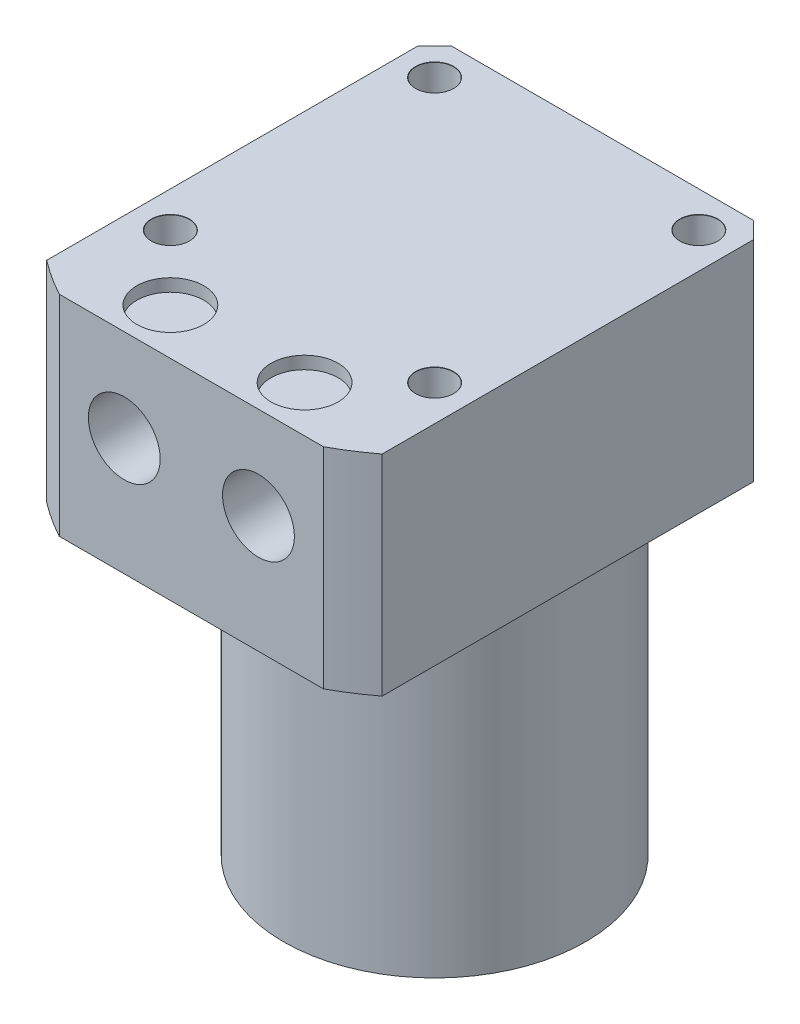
from build123d import *

# Parameters (mm, degrees)
SKETCH2_OUTSIDE_W                            = 90.692
SKETCH2_OUTSIDE_H                            = 90.692
SKETCH2_OUTSIDE_W_2                          = 40
SKETCH2_OUTSIDE_H_2                          = 49
CUT_EXTRUDE2_DEPTH                           = 80.613127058
CHAMFER1_SIZE                                = 2
F_8_0_8_DIAMETER_HOLE1_D                     = 8
F_8_0_8_DIAMETER_HOLE1_DEPTH                 = 1.5
G1_8_TAPPED_HOLE1_D                          = 8.566
G1_8_TAPPED_HOLE1_DEPTH                      = 22.18
CBORE_FOR_M4_HEX_SOCKET_HEAD_CAP_SCR_2_COUNT = 2
CBORE_FOR_M4_HEX_SOCKET_HEAD_CAP_SCR_2_PITCH = 31.5
CBORE_FOR_M4_HEX_SOCKET_HEAD_CAP_SCR_3_COUNT = 2
CBORE_FOR_M4_HEX_SOCKET_HEAD_CAP_SCR_3_PITCH = 44.547727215
CBORE_FOR_M4_HEX_SOCKET_HEAD_CAP_SCR_4_COUNT = 2
CBORE_FOR_M4_HEX_SOCKET_HEAD_CAP_SCR_4_PITCH = 31.5


with BuildPart() as part:
    # Sketch1 → Revolve1 (revolve)
    with BuildSketch(Plane.XY, mode=Mode.PRIVATE) as revolve1_sk:
        Polygon((0, 0), (-18, 0), (-18, 39.5), (-33, 39.5), (-33, 64.5), (0, 64.5), align=None)
    revolve(revolve1_sk.sketch.rotate(Axis((0, 87.050829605, 0), (0, -1, 0)), 270), axis=Axis((0, 87.050829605, 0), (0, -1, 0)))

    # Sketch2 outside → Cut-Extrude2 (cut, through all)
    with BuildSketch(Plane(origin=(0, 64.5, 0), x_dir=(1, 0, 0), z_dir=(0, 1, 0))):
        Rectangle(SKETCH2_OUTSIDE_W, SKETCH2_OUTSIDE_H)
        with Locations((0, -4.5)):
            Rectangle(SKETCH2_OUTSIDE_W_2, SKETCH2_OUTSIDE_H_2, mode=Mode.SUBTRACT)
    extrude(amount=-CUT_EXTRUDE2_DEPTH, mode=Mode.SUBTRACT)

    # Chamfer1
    chamfer1_edges = [part.edges().sort_by_distance(p)[0] for p in [
        (-20, 52, -20),
        (20, 52, -20),
    ]]
    chamfer(chamfer1_edges, length=CHAMFER1_SIZE)

    # 8.0 _8_ Diameter Hole1
    with Locations(Plane(origin=(-22.940510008, 64.5, 22.705104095), x_dir=(1, 0, 0), z_dir=(0, 1, 0))):
        with Locations((14.940510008, -0.794895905), (30.940510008, -0.794895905)):
            Hole(F_8_0_8_DIAMETER_HOLE1_D / 2, depth=F_8_0_8_DIAMETER_HOLE1_DEPTH)

    # G1_8 Tapped Hole1
    with Locations(Plane.XY.offset(29)):
        with Locations((-8, 53.5), (8, 53.5)):
            Hole(G1_8_TAPPED_HOLE1_D / 2, depth=G1_8_TAPPED_HOLE1_DEPTH)

    # Sketch7 → CBORE for M4 Hex Socket Head Cap Screw1 (revolve, cut)
    with BuildSketch(Plane(origin=(-15.75, 39.5, -15.75), x_dir=(0, 0, -1), z_dir=(1, 0, 0))):
        Polygon((0, 0), (0, 25), (2.275, 25), (2.25, 24.975), (2.25, 4), (4, 4), (4, 0), align=None)
    cbore_for_m4_hex_socket_head_cap_screw1 = revolve(axis=Axis((-15.75, 33.15, -15.75), (0, 1, 0)), mode=Mode.SUBTRACT)

    # CBORE for M4 Hex Socket Head Cap Scr 2: CBORE for M4 Hex Socket Head Cap Screw1 ×2
    with Locations(*[(i * CBORE_FOR_M4_HEX_SOCKET_HEAD_CAP_SCR_2_PITCH, 0, 0) for i in range(1, CBORE_FOR_M4_HEX_SOCKET_HEAD_CAP_SCR_2_COUNT)]):
        add(cbore_for_m4_hex_socket_head_cap_screw1, mode=Mode.SUBTRACT)

    # CBORE for M4 Hex Socket Head Cap Scr 3: CBORE for M4 Hex Socket Head Cap Screw1 ×2
    with Locations(*[Vector(0.7071067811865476, 0, 0.7071067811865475) * (i * CBORE_FOR_M4_HEX_SOCKET_HEAD_CAP_SCR_3_PITCH) for i in range(1, CBORE_FOR_M4_HEX_SOCKET_HEAD_CAP_SCR_3_COUNT)]):
        add(cbore_for_m4_hex_socket_head_cap_screw1, mode=Mode.SUBTRACT)

    # CBORE for M4 Hex Socket Head Cap Scr 4: CBORE for M4 Hex Socket Head Cap Screw1 ×2
    with Locations(*[(0, 0, i * CBORE_FOR_M4_HEX_SOCKET_HEAD_CAP_SCR_4_PITCH) for i in range(1, CBORE_FOR_M4_HEX_SOCKET_HEAD_CAP_SCR_4_COUNT)]):
        add(cbore_for_m4_hex_socket_head_cap_screw1, mode=Mode.SUBTRACT)


solid = part.part
